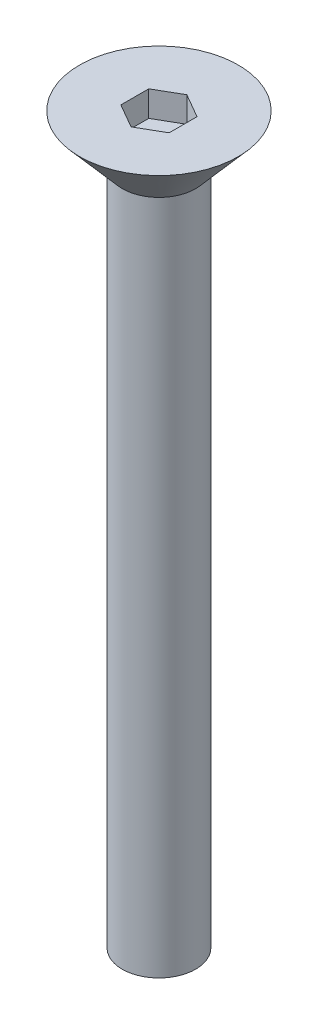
ISO-10303-21;
HEADER;
FILE_DESCRIPTION(('STEP AP214'),'2;1');
FILE_NAME('part.step','',(''),(''),'','','');
FILE_SCHEMA(('AUTOMOTIVE_DESIGN { 1 0 10303 214 1 1 1 1 }'));
ENDSEC;
DATA;
#1=APPLICATION_CONTEXT('core data for automotive mechanical design processes');
#2=APPLICATION_PROTOCOL_DEFINITION('international standard','automotive_design',2000,#1);
#3=PRODUCT_CONTEXT('',#1,'mechanical');
#4=PRODUCT('Part','Part','',(#3));
#5=PRODUCT_RELATED_PRODUCT_CATEGORY('part','',(#4));
#6=PRODUCT_DEFINITION_FORMATION('','',#4);
#7=PRODUCT_DEFINITION_CONTEXT('part definition',#1,'design');
#8=PRODUCT_DEFINITION('design','',#6,#7);
#9=PRODUCT_DEFINITION_SHAPE('','',#8);
#10=(LENGTH_UNIT() NAMED_UNIT(*) SI_UNIT(.MILLI.,.METRE.));
#11=(NAMED_UNIT(*) PLANE_ANGLE_UNIT() SI_UNIT($,.RADIAN.));
#12=(NAMED_UNIT(*) SI_UNIT($,.STERADIAN.) SOLID_ANGLE_UNIT());
#13=UNCERTAINTY_MEASURE_WITH_UNIT(LENGTH_MEASURE(1.E-05),#10,'distance_accuracy_value','');
#14=(GEOMETRIC_REPRESENTATION_CONTEXT(3) GLOBAL_UNCERTAINTY_ASSIGNED_CONTEXT((#13)) GLOBAL_UNIT_ASSIGNED_CONTEXT((#10,
#11,#12)) REPRESENTATION_CONTEXT('',''));
#15=CARTESIAN_POINT('',(0.,0.,0.));
#16=DIRECTION('',(0.,0.,1.));
#17=DIRECTION('',(1.,0.,0.));
#18=AXIS2_PLACEMENT_3D('',#15,#16,#17);
#19=CARTESIAN_POINT('',(2.41300000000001,-47.6787390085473,0.));
#20=DIRECTION('',(0.,-1.,0.));
#21=DIRECTION('',(0.,0.,-1.));
#22=AXIS2_PLACEMENT_3D('',#19,#20,#21);
#23=PLANE('',#22);
#24=CARTESIAN_POINT('',(0.,-47.6787390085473,0.));
#25=DIRECTION('',(0.,1.,0.));
#26=DIRECTION('',(0.,0.,1.));
#27=AXIS2_PLACEMENT_3D('',#24,#25,#26);
#28=CIRCLE('',#27,2.41300000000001);
#29=CARTESIAN_POINT('',(0.,-47.6787390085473,2.41300000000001));
#30=VERTEX_POINT('',#29);
#31=EDGE_CURVE('E11',#30,#30,#28,.T.);
#32=ORIENTED_EDGE('',*,*,#31,.F.);
#33=EDGE_LOOP('',(#32));
#34=FACE_BOUND('',#33,.T.);
#35=ADVANCED_FACE('F38',(#34),#23,.T.);
#36=CARTESIAN_POINT('',(0.,25.4,0.));
#37=DIRECTION('',(0.,1.,0.));
#38=DIRECTION('',(0.,0.,1.));
#39=AXIS2_PLACEMENT_3D('',#36,#37,#38);
#40=CYLINDRICAL_SURFACE('',#39,2.41300000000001);
#41=ORIENTED_EDGE('',*,*,#31,.T.);
#42=EDGE_LOOP('',(#41));
#43=FACE_BOUND('',#42,.T.);
#44=CARTESIAN_POINT('',(0.,-3.22873900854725,0.));
#45=DIRECTION('',(0.,1.,0.));
#46=DIRECTION('',(0.,0.,1.));
#47=AXIS2_PLACEMENT_3D('',#44,#45,#46);
#48=CIRCLE('',#47,2.413);
#49=CARTESIAN_POINT('',(0.,-3.22873900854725,2.413));
#50=VERTEX_POINT('',#49);
#51=EDGE_CURVE('E45',#50,#50,#48,.T.);
#52=ORIENTED_EDGE('',*,*,#51,.F.);
#53=EDGE_LOOP('',(#52));
#54=FACE_BOUND('',#53,.T.);
#55=ADVANCED_FACE('F151',(#43,#54),#40,.T.);
#56=CARTESIAN_POINT('',(0.,-3.22873900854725,0.));
#57=DIRECTION('',(0.,1.,0.));
#58=DIRECTION('',(0.,0.,1.));
#59=AXIS2_PLACEMENT_3D('',#56,#57,#58);
#60=CONICAL_SURFACE('',#59,2.413,0.715584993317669);
#61=CARTESIAN_POINT('',(0.,0.,0.));
#62=DIRECTION('',(0.,1.,0.));
#63=DIRECTION('',(0.,0.,1.));
#64=AXIS2_PLACEMENT_3D('',#61,#62,#63);
#65=CIRCLE('',#64,5.2197);
#66=CARTESIAN_POINT('',(0.,0.,5.2197));
#67=VERTEX_POINT('',#66);
#68=EDGE_CURVE('E138',#67,#67,#65,.T.);
#69=ORIENTED_EDGE('',*,*,#68,.F.);
#70=EDGE_LOOP('',(#69));
#71=FACE_BOUND('',#70,.T.);
#72=ORIENTED_EDGE('',*,*,#51,.T.);
#73=EDGE_LOOP('',(#72));
#74=FACE_BOUND('',#73,.T.);
#75=ADVANCED_FACE('F149',(#71,#74),#60,.T.);
#76=CARTESIAN_POINT('',(0.,0.,0.));
#77=DIRECTION('',(0.,1.,0.));
#78=DIRECTION('',(0.,0.,1.));
#79=AXIS2_PLACEMENT_3D('',#76,#77,#78);
#80=PLANE('',#79);
#81=DIRECTION('',(0.,0.,1.));
#82=VECTOR('',#81,1.);
#83=CARTESIAN_POINT('',(-1.5875,0.,-0.916543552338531));
#84=LINE('',#83,#82);
#85=CARTESIAN_POINT('',(-1.5875,0.,-0.916543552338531));
#86=VERTEX_POINT('',#85);
#87=CARTESIAN_POINT('',(-1.5875,0.,0.916543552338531));
#88=VERTEX_POINT('',#87);
#89=EDGE_CURVE('E52',#86,#88,#84,.T.);
#90=ORIENTED_EDGE('',*,*,#89,.F.);
#91=DIRECTION('',(-0.866025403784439,0.,0.5));
#92=VECTOR('',#91,1.);
#93=CARTESIAN_POINT('',(0.,0.,-1.83308710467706));
#94=LINE('',#93,#92);
#95=CARTESIAN_POINT('',(0.,0.,-1.83308710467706));
#96=VERTEX_POINT('',#95);
#97=EDGE_CURVE('E122',#96,#86,#94,.T.);
#98=ORIENTED_EDGE('',*,*,#97,.F.);
#99=DIRECTION('',(0.866025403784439,0.,0.5));
#100=VECTOR('',#99,1.);
#101=CARTESIAN_POINT('',(0.,0.,-1.83308710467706));
#102=LINE('',#101,#100);
#103=CARTESIAN_POINT('',(1.5875,0.,-0.916543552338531));
#104=VERTEX_POINT('',#103);
#105=EDGE_CURVE('E117',#96,#104,#102,.T.);
#106=ORIENTED_EDGE('',*,*,#105,.T.);
#107=DIRECTION('',(0.,0.,1.));
#108=VECTOR('',#107,1.);
#109=CARTESIAN_POINT('',(1.5875,0.,-0.916543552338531));
#110=LINE('',#109,#108);
#111=CARTESIAN_POINT('',(1.5875,0.,0.916543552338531));
#112=VERTEX_POINT('',#111);
#113=EDGE_CURVE('E115',#104,#112,#110,.T.);
#114=ORIENTED_EDGE('',*,*,#113,.T.);
#115=DIRECTION('',(0.86602540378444,0.,-0.499999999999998));
#116=VECTOR('',#115,1.);
#117=CARTESIAN_POINT('',(0.,0.,1.83308710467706));
#118=LINE('',#117,#116);
#119=CARTESIAN_POINT('',(0.,0.,1.83308710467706));
#120=VERTEX_POINT('',#119);
#121=EDGE_CURVE('E97',#120,#112,#118,.T.);
#122=ORIENTED_EDGE('',*,*,#121,.F.);
#123=DIRECTION('',(-0.86602540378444,0.,-0.499999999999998));
#124=VECTOR('',#123,1.);
#125=CARTESIAN_POINT('',(0.,0.,1.83308710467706));
#126=LINE('',#125,#124);
#127=EDGE_CURVE('E107',#120,#88,#126,.T.);
#128=ORIENTED_EDGE('',*,*,#127,.T.);
#129=EDGE_LOOP('',(#90,#98,#106,#114,#122,#128));
#130=FACE_BOUND('',#129,.T.);
#131=ORIENTED_EDGE('',*,*,#68,.T.);
#132=EDGE_LOOP('',(#131));
#133=FACE_BOUND('',#132,.T.);
#134=ADVANCED_FACE('F111',(#130,#133),#80,.T.);
#135=CARTESIAN_POINT('',(-1.5875,-1.68402,-0.916543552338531));
#136=DIRECTION('',(-1.,0.,0.));
#137=DIRECTION('',(0.,0.,1.));
#138=AXIS2_PLACEMENT_3D('',#135,#136,#137);
#139=PLANE('',#138);
#140=ORIENTED_EDGE('',*,*,#89,.T.);
#141=DIRECTION('',(0.,1.,0.));
#142=VECTOR('',#141,1.);
#143=CARTESIAN_POINT('',(-1.5875,-1.68402,0.916543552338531));
#144=LINE('',#143,#142);
#145=CARTESIAN_POINT('',(-1.5875,-1.68402,0.916543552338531));
#146=VERTEX_POINT('',#145);
#147=EDGE_CURVE('E104',#146,#88,#144,.T.);
#148=ORIENTED_EDGE('',*,*,#147,.F.);
#149=DIRECTION('',(0.,0.,1.));
#150=VECTOR('',#149,1.);
#151=CARTESIAN_POINT('',(-1.5875,-1.68402,-0.916543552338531));
#152=LINE('',#151,#150);
#153=CARTESIAN_POINT('',(-1.5875,-1.68402,-0.916543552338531));
#154=VERTEX_POINT('',#153);
#155=EDGE_CURVE('E124',#154,#146,#152,.T.);
#156=ORIENTED_EDGE('',*,*,#155,.F.);
#157=DIRECTION('',(0.,1.,0.));
#158=VECTOR('',#157,1.);
#159=CARTESIAN_POINT('',(-1.5875,-1.68402,-0.916543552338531));
#160=LINE('',#159,#158);
#161=EDGE_CURVE('E59',#154,#86,#160,.T.);
#162=ORIENTED_EDGE('',*,*,#161,.T.);
#163=EDGE_LOOP('',(#140,#148,#156,#162));
#164=FACE_BOUND('',#163,.T.);
#165=ADVANCED_FACE('F164',(#164),#139,.F.);
#166=CARTESIAN_POINT('',(0.,-1.68402,-1.83308710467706));
#167=DIRECTION('',(-0.5,0.,-0.866025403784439));
#168=DIRECTION('',(-0.866025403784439,0.,0.5));
#169=AXIS2_PLACEMENT_3D('',#166,#167,#168);
#170=PLANE('',#169);
#171=ORIENTED_EDGE('',*,*,#97,.T.);
#172=ORIENTED_EDGE('',*,*,#161,.F.);
#173=DIRECTION('',(-0.866025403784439,0.,0.5));
#174=VECTOR('',#173,1.);
#175=CARTESIAN_POINT('',(0.,-1.68402,-1.83308710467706));
#176=LINE('',#175,#174);
#177=CARTESIAN_POINT('',(0.,-1.68402,-1.83308710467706));
#178=VERTEX_POINT('',#177);
#179=EDGE_CURVE('E134',#178,#154,#176,.T.);
#180=ORIENTED_EDGE('',*,*,#179,.F.);
#181=DIRECTION('',(0.,1.,0.));
#182=VECTOR('',#181,1.);
#183=CARTESIAN_POINT('',(0.,-1.68402,-1.83308710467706));
#184=LINE('',#183,#182);
#185=EDGE_CURVE('E139',#178,#96,#184,.T.);
#186=ORIENTED_EDGE('',*,*,#185,.T.);
#187=EDGE_LOOP('',(#171,#172,#180,#186));
#188=FACE_BOUND('',#187,.T.);
#189=ADVANCED_FACE('F167',(#188),#170,.F.);
#190=CARTESIAN_POINT('',(0.,-1.68402,-1.83308710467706));
#191=DIRECTION('',(-0.5,0.,0.866025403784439));
#192=DIRECTION('',(0.866025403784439,0.,0.5));
#193=AXIS2_PLACEMENT_3D('',#190,#191,#192);
#194=PLANE('',#193);
#195=ORIENTED_EDGE('',*,*,#105,.F.);
#196=ORIENTED_EDGE('',*,*,#185,.F.);
#197=DIRECTION('',(0.866025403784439,0.,0.5));
#198=VECTOR('',#197,1.);
#199=CARTESIAN_POINT('',(0.,-1.68402,-1.83308710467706));
#200=LINE('',#199,#198);
#201=CARTESIAN_POINT('',(1.5875,-1.68402,-0.916543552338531));
#202=VERTEX_POINT('',#201);
#203=EDGE_CURVE('E132',#178,#202,#200,.T.);
#204=ORIENTED_EDGE('',*,*,#203,.T.);
#205=DIRECTION('',(0.,1.,0.));
#206=VECTOR('',#205,1.);
#207=CARTESIAN_POINT('',(1.5875,-1.68402,-0.916543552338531));
#208=LINE('',#207,#206);
#209=EDGE_CURVE('E141',#202,#104,#208,.T.);
#210=ORIENTED_EDGE('',*,*,#209,.T.);
#211=EDGE_LOOP('',(#195,#196,#204,#210));
#212=FACE_BOUND('',#211,.T.);
#213=ADVANCED_FACE('F176',(#212),#194,.T.);
#214=CARTESIAN_POINT('',(1.5875,-1.68402,-0.916543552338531));
#215=DIRECTION('',(-1.,0.,0.));
#216=DIRECTION('',(0.,0.,1.));
#217=AXIS2_PLACEMENT_3D('',#214,#215,#216);
#218=PLANE('',#217);
#219=ORIENTED_EDGE('',*,*,#113,.F.);
#220=ORIENTED_EDGE('',*,*,#209,.F.);
#221=DIRECTION('',(0.,0.,1.));
#222=VECTOR('',#221,1.);
#223=CARTESIAN_POINT('',(1.5875,-1.68402,-0.916543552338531));
#224=LINE('',#223,#222);
#225=CARTESIAN_POINT('',(1.5875,-1.68402,0.916543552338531));
#226=VERTEX_POINT('',#225);
#227=EDGE_CURVE('E130',#202,#226,#224,.T.);
#228=ORIENTED_EDGE('',*,*,#227,.T.);
#229=DIRECTION('',(0.,1.,0.));
#230=VECTOR('',#229,1.);
#231=CARTESIAN_POINT('',(1.5875,-1.68402,0.916543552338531));
#232=LINE('',#231,#230);
#233=EDGE_CURVE('E103',#226,#112,#232,.T.);
#234=ORIENTED_EDGE('',*,*,#233,.T.);
#235=EDGE_LOOP('',(#219,#220,#228,#234));
#236=FACE_BOUND('',#235,.T.);
#237=ADVANCED_FACE('F173',(#236),#218,.T.);
#238=CARTESIAN_POINT('',(0.,-1.68402,1.83308710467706));
#239=DIRECTION('',(0.499999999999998,0.,0.86602540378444));
#240=DIRECTION('',(0.86602540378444,0.,-0.499999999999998));
#241=AXIS2_PLACEMENT_3D('',#238,#239,#240);
#242=PLANE('',#241);
#243=ORIENTED_EDGE('',*,*,#121,.T.);
#244=ORIENTED_EDGE('',*,*,#233,.F.);
#245=DIRECTION('',(0.86602540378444,0.,-0.499999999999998));
#246=VECTOR('',#245,1.);
#247=CARTESIAN_POINT('',(0.,-1.68402,1.83308710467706));
#248=LINE('',#247,#246);
#249=CARTESIAN_POINT('',(0.,-1.68402,1.83308710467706));
#250=VERTEX_POINT('',#249);
#251=EDGE_CURVE('E100',#250,#226,#248,.T.);
#252=ORIENTED_EDGE('',*,*,#251,.F.);
#253=DIRECTION('',(0.,1.,0.));
#254=VECTOR('',#253,1.);
#255=CARTESIAN_POINT('',(0.,-1.68402,1.83308710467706));
#256=LINE('',#255,#254);
#257=EDGE_CURVE('E92',#250,#120,#256,.T.);
#258=ORIENTED_EDGE('',*,*,#257,.T.);
#259=EDGE_LOOP('',(#243,#244,#252,#258));
#260=FACE_BOUND('',#259,.T.);
#261=ADVANCED_FACE('F94',(#260),#242,.F.);
#262=CARTESIAN_POINT('',(0.,-1.68402,1.83308710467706));
#263=DIRECTION('',(0.499999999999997,0.,-0.86602540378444));
#264=DIRECTION('',(-0.86602540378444,0.,-0.499999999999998));
#265=AXIS2_PLACEMENT_3D('',#262,#263,#264);
#266=PLANE('',#265);
#267=ORIENTED_EDGE('',*,*,#127,.F.);
#268=ORIENTED_EDGE('',*,*,#257,.F.);
#269=DIRECTION('',(-0.86602540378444,0.,-0.499999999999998));
#270=VECTOR('',#269,1.);
#271=CARTESIAN_POINT('',(0.,-1.68402,1.83308710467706));
#272=LINE('',#271,#270);
#273=EDGE_CURVE('E127',#250,#146,#272,.T.);
#274=ORIENTED_EDGE('',*,*,#273,.T.);
#275=ORIENTED_EDGE('',*,*,#147,.T.);
#276=EDGE_LOOP('',(#267,#268,#274,#275));
#277=FACE_BOUND('',#276,.T.);
#278=ADVANCED_FACE('F108',(#277),#266,.T.);
#279=CARTESIAN_POINT('',(-1.5875,-1.68402,0.916543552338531));
#280=DIRECTION('',(0.,-1.,0.));
#281=DIRECTION('',(0.,0.,-1.));
#282=AXIS2_PLACEMENT_3D('',#279,#280,#281);
#283=PLANE('',#282);
#284=ORIENTED_EDGE('',*,*,#155,.T.);
#285=ORIENTED_EDGE('',*,*,#273,.F.);
#286=ORIENTED_EDGE('',*,*,#251,.T.);
#287=ORIENTED_EDGE('',*,*,#227,.F.);
#288=ORIENTED_EDGE('',*,*,#203,.F.);
#289=ORIENTED_EDGE('',*,*,#179,.T.);
#290=EDGE_LOOP('',(#284,#285,#286,#287,#288,#289));
#291=FACE_BOUND('',#290,.T.);
#292=ADVANCED_FACE('F170',(#291),#283,.F.);
#293=CLOSED_SHELL('',(#35,#55,#75,#134,#165,#189,#213,#237,#261,#278,#292));
#294=MANIFOLD_SOLID_BREP('B2',#293);
#295=ADVANCED_BREP_SHAPE_REPRESENTATION('',(#18,#294),#14);
#296=SHAPE_DEFINITION_REPRESENTATION(#9,#295);
ENDSEC;
END-ISO-10303-21;
